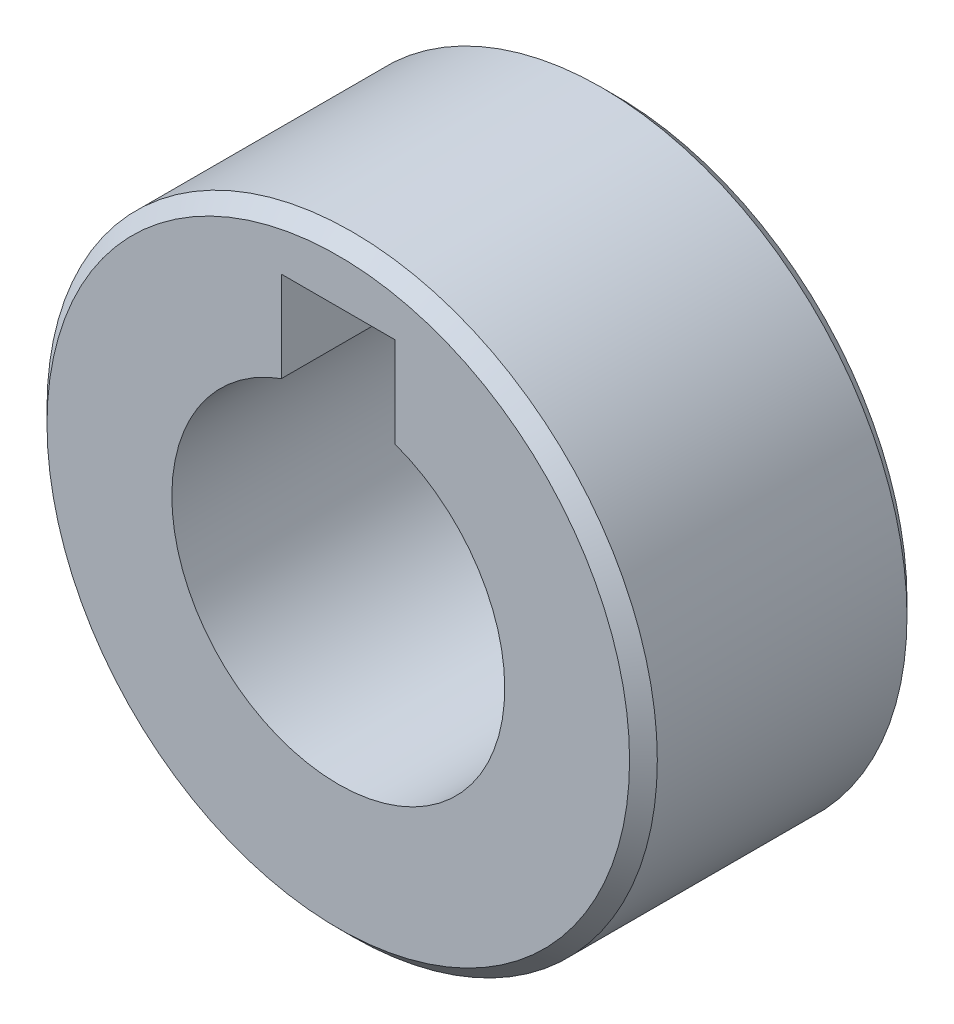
ISO-10303-21;
HEADER;
FILE_DESCRIPTION(('STEP AP214'),'2;1');
FILE_NAME('part.step','',(''),(''),'','','');
FILE_SCHEMA(('AUTOMOTIVE_DESIGN { 1 0 10303 214 1 1 1 1 }'));
ENDSEC;
DATA;
#1=APPLICATION_CONTEXT('core data for automotive mechanical design processes');
#2=APPLICATION_PROTOCOL_DEFINITION('international standard','automotive_design',2000,#1);
#3=PRODUCT_CONTEXT('',#1,'mechanical');
#4=PRODUCT('Part','Part','',(#3));
#5=PRODUCT_RELATED_PRODUCT_CATEGORY('part','',(#4));
#6=PRODUCT_DEFINITION_FORMATION('','',#4);
#7=PRODUCT_DEFINITION_CONTEXT('part definition',#1,'design');
#8=PRODUCT_DEFINITION('design','',#6,#7);
#9=PRODUCT_DEFINITION_SHAPE('','',#8);
#10=(LENGTH_UNIT() NAMED_UNIT(*) SI_UNIT(.MILLI.,.METRE.));
#11=(NAMED_UNIT(*) PLANE_ANGLE_UNIT() SI_UNIT($,.RADIAN.));
#12=(NAMED_UNIT(*) SI_UNIT($,.STERADIAN.) SOLID_ANGLE_UNIT());
#13=UNCERTAINTY_MEASURE_WITH_UNIT(LENGTH_MEASURE(1.E-05),#10,'distance_accuracy_value','');
#14=(GEOMETRIC_REPRESENTATION_CONTEXT(3) GLOBAL_UNCERTAINTY_ASSIGNED_CONTEXT((#13)) GLOBAL_UNIT_ASSIGNED_CONTEXT((#10,
#11,#12)) REPRESENTATION_CONTEXT('',''));
#15=CARTESIAN_POINT('',(0.,0.,0.));
#16=DIRECTION('',(0.,0.,1.));
#17=DIRECTION('',(1.,0.,0.));
#18=AXIS2_PLACEMENT_3D('',#15,#16,#17);
#19=CARTESIAN_POINT('',(0.,0.,10.));
#20=DIRECTION('',(0.,0.,1.));
#21=DIRECTION('',(1.,0.,0.));
#22=AXIS2_PLACEMENT_3D('',#19,#20,#21);
#23=PLANE('',#22);
#24=DIRECTION('',(0.,-1.,0.));
#25=VECTOR('',#24,1.);
#26=CARTESIAN_POINT('',(-2.05,5.63892720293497,10.));
#27=LINE('',#26,#25);
#28=CARTESIAN_POINT('',(-2.05,8.9,10.));
#29=VERTEX_POINT('',#28);
#30=CARTESIAN_POINT('',(-2.05,5.63892720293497,10.));
#31=VERTEX_POINT('',#30);
#32=EDGE_CURVE('E141',#29,#31,#27,.T.);
#33=ORIENTED_EDGE('',*,*,#32,.F.);
#34=DIRECTION('',(-1.,0.,0.));
#35=VECTOR('',#34,1.);
#36=CARTESIAN_POINT('',(-2.05,8.9,10.));
#37=LINE('',#36,#35);
#38=CARTESIAN_POINT('',(2.05,8.9,10.));
#39=VERTEX_POINT('',#38);
#40=EDGE_CURVE('E90',#39,#29,#37,.T.);
#41=ORIENTED_EDGE('',*,*,#40,.F.);
#42=DIRECTION('',(0.,1.,0.));
#43=VECTOR('',#42,1.);
#44=CARTESIAN_POINT('',(2.05,5.63892720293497,10.));
#45=LINE('',#44,#43);
#46=CARTESIAN_POINT('',(2.05,5.63892720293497,10.));
#47=VERTEX_POINT('',#46);
#48=EDGE_CURVE('E75',#47,#39,#45,.T.);
#49=ORIENTED_EDGE('',*,*,#48,.F.);
#50=CARTESIAN_POINT('',(0.,0.,10.));
#51=DIRECTION('',(0.,0.,1.));
#52=DIRECTION('',(1.,0.,0.));
#53=AXIS2_PLACEMENT_3D('',#50,#51,#52);
#54=CIRCLE('',#53,6.);
#55=EDGE_CURVE('E88',#31,#47,#54,.T.);
#56=ORIENTED_EDGE('',*,*,#55,.F.);
#57=EDGE_LOOP('',(#33,#41,#49,#56));
#58=FACE_BOUND('',#57,.T.);
#59=CARTESIAN_POINT('',(0.,0.,10.));
#60=DIRECTION('',(0.,0.,1.));
#61=DIRECTION('',(1.,0.,0.));
#62=AXIS2_PLACEMENT_3D('',#59,#60,#61);
#63=CIRCLE('',#62,10.5);
#64=CARTESIAN_POINT('',(10.5,0.,10.));
#65=VERTEX_POINT('',#64);
#66=EDGE_CURVE('E11',#65,#65,#63,.T.);
#67=ORIENTED_EDGE('',*,*,#66,.T.);
#68=EDGE_LOOP('',(#67));
#69=FACE_BOUND('',#68,.T.);
#70=ADVANCED_FACE('F32',(#58,#69),#23,.T.);
#71=CARTESIAN_POINT('',(0.,0.,0.));
#72=DIRECTION('',(0.,0.,1.));
#73=DIRECTION('',(1.,0.,0.));
#74=AXIS2_PLACEMENT_3D('',#71,#72,#73);
#75=PLANE('',#74);
#76=CARTESIAN_POINT('',(0.,0.,0.));
#77=DIRECTION('',(0.,0.,1.));
#78=DIRECTION('',(1.,0.,0.));
#79=AXIS2_PLACEMENT_3D('',#76,#77,#78);
#80=CIRCLE('',#79,10.5);
#81=CARTESIAN_POINT('',(10.5,0.,0.));
#82=VERTEX_POINT('',#81);
#83=EDGE_CURVE('E40',#82,#82,#80,.F.);
#84=ORIENTED_EDGE('',*,*,#83,.T.);
#85=EDGE_LOOP('',(#84));
#86=FACE_BOUND('',#85,.T.);
#87=DIRECTION('',(-1.,0.,0.));
#88=VECTOR('',#87,1.);
#89=CARTESIAN_POINT('',(-2.05,8.9,0.));
#90=LINE('',#89,#88);
#91=CARTESIAN_POINT('',(2.05,8.9,0.));
#92=VERTEX_POINT('',#91);
#93=CARTESIAN_POINT('',(-2.05,8.9,0.));
#94=VERTEX_POINT('',#93);
#95=EDGE_CURVE('E144',#92,#94,#90,.T.);
#96=ORIENTED_EDGE('',*,*,#95,.T.);
#97=DIRECTION('',(0.,-1.,0.));
#98=VECTOR('',#97,1.);
#99=CARTESIAN_POINT('',(-2.05,5.63892720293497,0.));
#100=LINE('',#99,#98);
#101=CARTESIAN_POINT('',(-2.05,5.63892720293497,0.));
#102=VERTEX_POINT('',#101);
#103=EDGE_CURVE('E82',#94,#102,#100,.T.);
#104=ORIENTED_EDGE('',*,*,#103,.T.);
#105=CARTESIAN_POINT('',(0.,0.,0.));
#106=DIRECTION('',(0.,0.,1.));
#107=DIRECTION('',(1.,0.,0.));
#108=AXIS2_PLACEMENT_3D('',#105,#106,#107);
#109=CIRCLE('',#108,6.);
#110=CARTESIAN_POINT('',(2.05,5.63892720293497,0.));
#111=VERTEX_POINT('',#110);
#112=EDGE_CURVE('E94',#102,#111,#109,.T.);
#113=ORIENTED_EDGE('',*,*,#112,.T.);
#114=DIRECTION('',(0.,1.,0.));
#115=VECTOR('',#114,1.);
#116=CARTESIAN_POINT('',(2.05,5.63892720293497,0.));
#117=LINE('',#116,#115);
#118=EDGE_CURVE('E47',#111,#92,#117,.T.);
#119=ORIENTED_EDGE('',*,*,#118,.T.);
#120=EDGE_LOOP('',(#96,#104,#113,#119));
#121=FACE_BOUND('',#120,.T.);
#122=ADVANCED_FACE('F105',(#86,#121),#75,.F.);
#123=CARTESIAN_POINT('',(0.,0.,10.));
#124=DIRECTION('',(0.,0.,-1.));
#125=DIRECTION('',(-1.,0.,0.));
#126=AXIS2_PLACEMENT_3D('',#123,#124,#125);
#127=CYLINDRICAL_SURFACE('',#126,11.);
#128=CARTESIAN_POINT('',(0.,0.,0.500000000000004));
#129=DIRECTION('',(0.,0.,1.));
#130=DIRECTION('',(1.,0.,0.));
#131=AXIS2_PLACEMENT_3D('',#128,#129,#130);
#132=CIRCLE('',#131,11.);
#133=CARTESIAN_POINT('',(11.,0.,0.500000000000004));
#134=VERTEX_POINT('',#133);
#135=EDGE_CURVE('E97',#134,#134,#132,.T.);
#136=ORIENTED_EDGE('',*,*,#135,.T.);
#137=EDGE_LOOP('',(#136));
#138=FACE_BOUND('',#137,.T.);
#139=CARTESIAN_POINT('',(0.,0.,9.5));
#140=DIRECTION('',(0.,0.,1.));
#141=DIRECTION('',(1.,0.,0.));
#142=AXIS2_PLACEMENT_3D('',#139,#140,#141);
#143=CIRCLE('',#142,11.);
#144=CARTESIAN_POINT('',(11.,0.,9.5));
#145=VERTEX_POINT('',#144);
#146=EDGE_CURVE('E93',#145,#145,#143,.F.);
#147=ORIENTED_EDGE('',*,*,#146,.T.);
#148=EDGE_LOOP('',(#147));
#149=FACE_BOUND('',#148,.T.);
#150=ADVANCED_FACE('F34',(#138,#149),#127,.T.);
#151=CARTESIAN_POINT('',(0.,0.,10.));
#152=DIRECTION('',(0.,0.,-1.));
#153=DIRECTION('',(-1.,0.,0.));
#154=AXIS2_PLACEMENT_3D('',#151,#152,#153);
#155=CYLINDRICAL_SURFACE('',#154,6.);
#156=DIRECTION('',(0.,0.,1.));
#157=VECTOR('',#156,1.);
#158=CARTESIAN_POINT('',(-2.05,5.63892720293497,0.));
#159=LINE('',#158,#157);
#160=EDGE_CURVE('E55',#102,#31,#159,.T.);
#161=ORIENTED_EDGE('',*,*,#160,.T.);
#162=ORIENTED_EDGE('',*,*,#55,.T.);
#163=DIRECTION('',(0.,0.,1.));
#164=VECTOR('',#163,1.);
#165=CARTESIAN_POINT('',(2.05,5.63892720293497,0.));
#166=LINE('',#165,#164);
#167=EDGE_CURVE('E72',#111,#47,#166,.T.);
#168=ORIENTED_EDGE('',*,*,#167,.F.);
#169=ORIENTED_EDGE('',*,*,#112,.F.);
#170=EDGE_LOOP('',(#161,#162,#168,#169));
#171=FACE_BOUND('',#170,.T.);
#172=ADVANCED_FACE('F92',(#171),#155,.F.);
#173=CARTESIAN_POINT('',(0.,0.,0.500000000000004));
#174=DIRECTION('',(0.,0.,1.));
#175=DIRECTION('',(1.,0.,0.));
#176=AXIS2_PLACEMENT_3D('',#173,#174,#175);
#177=CONICAL_SURFACE('',#176,11.,0.78539816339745);
#178=ORIENTED_EDGE('',*,*,#83,.F.);
#179=EDGE_LOOP('',(#178));
#180=FACE_BOUND('',#179,.T.);
#181=ORIENTED_EDGE('',*,*,#135,.F.);
#182=EDGE_LOOP('',(#181));
#183=FACE_BOUND('',#182,.T.);
#184=ADVANCED_FACE('F108',(#180,#183),#177,.T.);
#185=CARTESIAN_POINT('',(0.,0.,10.));
#186=DIRECTION('',(0.,0.,-1.));
#187=DIRECTION('',(-1.,0.,0.));
#188=AXIS2_PLACEMENT_3D('',#185,#186,#187);
#189=CONICAL_SURFACE('',#188,10.5,0.785398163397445);
#190=ORIENTED_EDGE('',*,*,#146,.F.);
#191=EDGE_LOOP('',(#190));
#192=FACE_BOUND('',#191,.T.);
#193=ORIENTED_EDGE('',*,*,#66,.F.);
#194=EDGE_LOOP('',(#193));
#195=FACE_BOUND('',#194,.T.);
#196=ADVANCED_FACE('F111',(#192,#195),#189,.T.);
#197=CARTESIAN_POINT('',(-2.05,5.63892720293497,0.));
#198=DIRECTION('',(-1.,0.,0.));
#199=DIRECTION('',(0.,0.,1.));
#200=AXIS2_PLACEMENT_3D('',#197,#198,#199);
#201=PLANE('',#200);
#202=ORIENTED_EDGE('',*,*,#32,.T.);
#203=ORIENTED_EDGE('',*,*,#160,.F.);
#204=ORIENTED_EDGE('',*,*,#103,.F.);
#205=DIRECTION('',(0.,0.,1.));
#206=VECTOR('',#205,1.);
#207=CARTESIAN_POINT('',(-2.05,8.9,0.));
#208=LINE('',#207,#206);
#209=EDGE_CURVE('E142',#94,#29,#208,.T.);
#210=ORIENTED_EDGE('',*,*,#209,.T.);
#211=EDGE_LOOP('',(#202,#203,#204,#210));
#212=FACE_BOUND('',#211,.T.);
#213=ADVANCED_FACE('F121',(#212),#201,.F.);
#214=CARTESIAN_POINT('',(-2.05,8.9,0.));
#215=DIRECTION('',(0.,1.,0.));
#216=DIRECTION('',(0.,0.,1.));
#217=AXIS2_PLACEMENT_3D('',#214,#215,#216);
#218=PLANE('',#217);
#219=ORIENTED_EDGE('',*,*,#40,.T.);
#220=ORIENTED_EDGE('',*,*,#209,.F.);
#221=ORIENTED_EDGE('',*,*,#95,.F.);
#222=DIRECTION('',(0.,0.,1.));
#223=VECTOR('',#222,1.);
#224=CARTESIAN_POINT('',(2.05,8.9,0.));
#225=LINE('',#224,#223);
#226=EDGE_CURVE('E81',#92,#39,#225,.T.);
#227=ORIENTED_EDGE('',*,*,#226,.T.);
#228=EDGE_LOOP('',(#219,#220,#221,#227));
#229=FACE_BOUND('',#228,.T.);
#230=ADVANCED_FACE('F134',(#229),#218,.F.);
#231=CARTESIAN_POINT('',(2.05,5.63892720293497,0.));
#232=DIRECTION('',(1.,0.,0.));
#233=DIRECTION('',(0.,0.,-1.));
#234=AXIS2_PLACEMENT_3D('',#231,#232,#233);
#235=PLANE('',#234);
#236=ORIENTED_EDGE('',*,*,#48,.T.);
#237=ORIENTED_EDGE('',*,*,#226,.F.);
#238=ORIENTED_EDGE('',*,*,#118,.F.);
#239=ORIENTED_EDGE('',*,*,#167,.T.);
#240=EDGE_LOOP('',(#236,#237,#238,#239));
#241=FACE_BOUND('',#240,.T.);
#242=ADVANCED_FACE('F74',(#241),#235,.F.);
#243=CLOSED_SHELL('',(#70,#122,#150,#172,#184,#196,#213,#230,#242));
#244=MANIFOLD_SOLID_BREP('B2',#243);
#245=ADVANCED_BREP_SHAPE_REPRESENTATION('',(#18,#244),#14);
#246=SHAPE_DEFINITION_REPRESENTATION(#9,#245);
ENDSEC;
END-ISO-10303-21;
